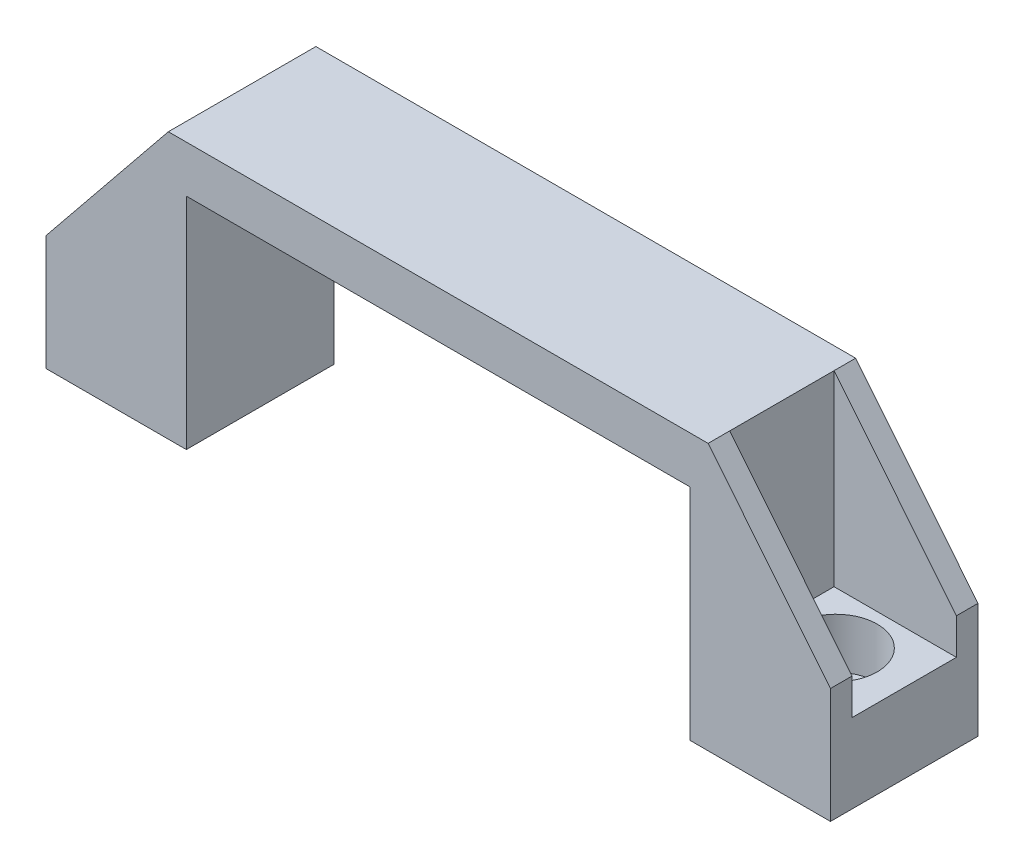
from build123d import *

# Parameters (mm, degrees)
EXTRUDE_1_DEPTH     = 10.25
SKETCH_2_R          = 3.25
SKETCH_2_R_2        = 2.99513601
CUT_EXTRUDE_1_DEPTH = 67.665677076
SKETCH_3_W          = 17
SKETCH_3_H          = 14.5
CUT_EXTRUDE_2_DEPTH = 26
SKETCH_4_R          = 5.75
CUT_EXTRUDE_3_DEPTH = 7


with BuildPart() as part:
    # Sketch 1 → Extrude 1 (new, symmetric)
    with BuildSketch(Plane.XY):
        Polygon((-54.5, 0), (-35, 0), (-35, 30.5), (35, 30.5), (35, 0), (54.5, 0), (54.5, 16), (37.5, 37), (-37.5, 37), (-54.5, 16), align=None)
    extrude(amount=EXTRUDE_1_DEPTH, both=True)

    # Sketch 2 → Cut-Extrude 1 (cut, through all)
    with BuildSketch(Plane.XZ):
        with Locations(Location((-45, 0, 0), (0, 0, 270))):
            Circle(SKETCH_2_R)
        with Locations(Location((45, 0, 0), (0, 0, 270))):
            Circle(SKETCH_2_R_2)
    cut_extrude_1 = extrude(amount=-CUT_EXTRUDE_1_DEPTH, mode=Mode.SUBTRACT)

    # Mirror 1: Cut-Extrude 1 across plane
    add(cut_extrude_1.mirror(Plane(origin=(0, 0, 0), x_dir=(0, 0, 1), z_dir=(1, 0, 0))), mode=Mode.SUBTRACT)

    # Sketch 3 → Cut-Extrude 2 (cut)
    with BuildSketch(Plane(origin=(0, 37, 0), x_dir=(1, 0, 0), z_dir=(0, 1, 0))):
        with Locations((-46, 0)):
            Rectangle(SKETCH_3_W, SKETCH_3_H)
    cut_extrude_2 = extrude(amount=-CUT_EXTRUDE_2_DEPTH, mode=Mode.SUBTRACT)

    # Mirror 2: Cut-Extrude 2 across plane
    add(cut_extrude_2.mirror(Plane(origin=(0, 0, 0), x_dir=(0, 0, 1), z_dir=(1, 0, 0))), mode=Mode.SUBTRACT)

    # Sketch 4 → Cut-Extrude 3 (cut)
    with BuildSketch(Plane(origin=(0, 11, 0), x_dir=(1, 0, 0), z_dir=(0, 1, 0))):
        with Locations(Location((-45, 0, 0), (0, 0, 270))):
            Circle(SKETCH_4_R)
        with Locations(Location((45, 0, 0), (0, 0, 270))):
            Circle(SKETCH_4_R)
    extrude(amount=-CUT_EXTRUDE_3_DEPTH, mode=Mode.SUBTRACT)


solid = part.part
